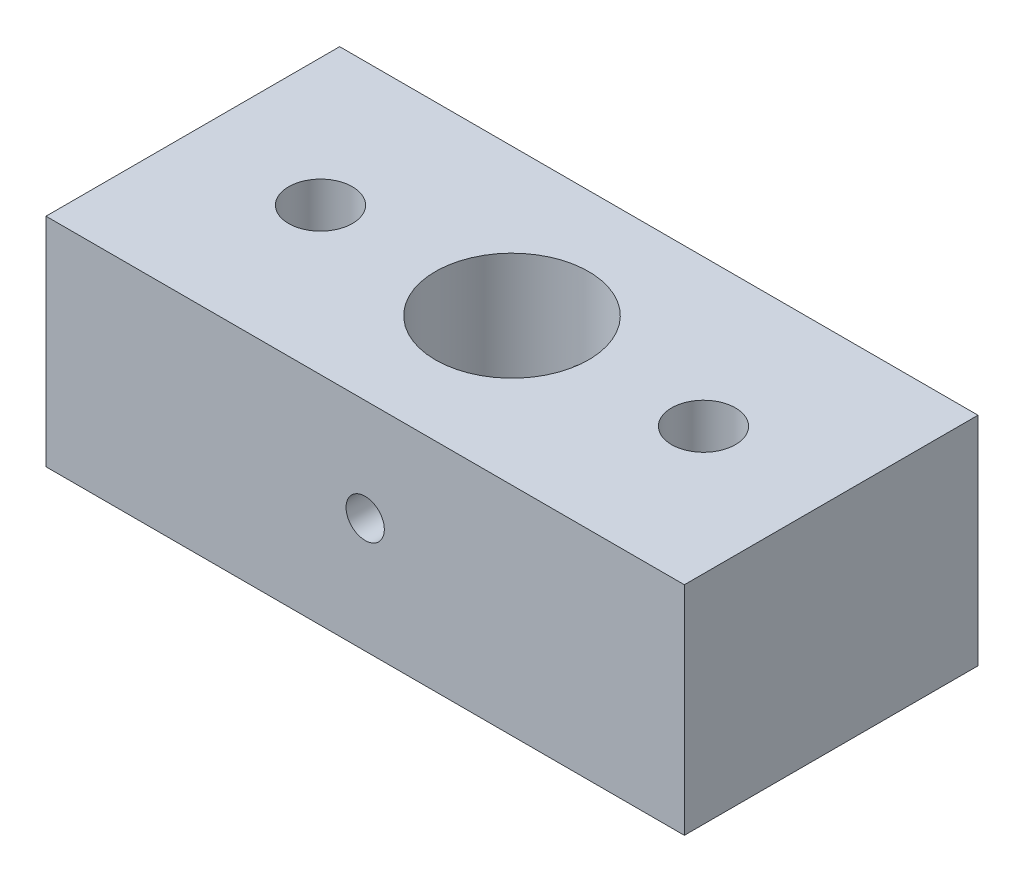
ISO-10303-21;
HEADER;
FILE_DESCRIPTION(('STEP AP214'),'2;1');
FILE_NAME('part.step','',(''),(''),'','','');
FILE_SCHEMA(('AUTOMOTIVE_DESIGN { 1 0 10303 214 1 1 1 1 }'));
ENDSEC;
DATA;
#1=APPLICATION_CONTEXT('core data for automotive mechanical design processes');
#2=APPLICATION_PROTOCOL_DEFINITION('international standard','automotive_design',2000,#1);
#3=PRODUCT_CONTEXT('',#1,'mechanical');
#4=PRODUCT('Part','Part','',(#3));
#5=PRODUCT_RELATED_PRODUCT_CATEGORY('part','',(#4));
#6=PRODUCT_DEFINITION_FORMATION('','',#4);
#7=PRODUCT_DEFINITION_CONTEXT('part definition',#1,'design');
#8=PRODUCT_DEFINITION('design','',#6,#7);
#9=PRODUCT_DEFINITION_SHAPE('','',#8);
#10=(LENGTH_UNIT() NAMED_UNIT(*) SI_UNIT(.MILLI.,.METRE.));
#11=(NAMED_UNIT(*) PLANE_ANGLE_UNIT() SI_UNIT($,.RADIAN.));
#12=(NAMED_UNIT(*) SI_UNIT($,.STERADIAN.) SOLID_ANGLE_UNIT());
#13=UNCERTAINTY_MEASURE_WITH_UNIT(LENGTH_MEASURE(1.E-05),#10,'distance_accuracy_value','');
#14=(GEOMETRIC_REPRESENTATION_CONTEXT(3) GLOBAL_UNCERTAINTY_ASSIGNED_CONTEXT((#13)) GLOBAL_UNIT_ASSIGNED_CONTEXT((#10,
#11,#12)) REPRESENTATION_CONTEXT('',''));
#15=CARTESIAN_POINT('',(0.,0.,0.));
#16=DIRECTION('',(0.,0.,1.));
#17=DIRECTION('',(1.,0.,0.));
#18=AXIS2_PLACEMENT_3D('',#15,#16,#17);
#19=CARTESIAN_POINT('',(7.41385041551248,-6.42728531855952,23.));
#20=DIRECTION('',(1.,0.,0.));
#21=DIRECTION('',(0.,1.,0.));
#22=AXIS2_PLACEMENT_3D('',#19,#20,#21);
#23=PLANE('',#22);
#24=DIRECTION('',(0.,-1.,0.));
#25=VECTOR('',#24,1.);
#26=CARTESIAN_POINT('',(7.41385041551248,-6.42728531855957,0.));
#27=LINE('',#26,#25);
#28=CARTESIAN_POINT('',(7.41385041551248,-6.42728531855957,0.));
#29=VERTEX_POINT('',#28);
#30=CARTESIAN_POINT('',(7.41385041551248,-23.4272853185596,0.));
#31=VERTEX_POINT('',#30);
#32=EDGE_CURVE('E80',#29,#31,#27,.T.);
#33=ORIENTED_EDGE('',*,*,#32,.T.);
#34=DIRECTION('',(0.,0.,-1.));
#35=VECTOR('',#34,1.);
#36=CARTESIAN_POINT('',(7.41385041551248,-23.4272853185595,23.));
#37=LINE('',#36,#35);
#38=CARTESIAN_POINT('',(7.41385041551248,-23.4272853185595,23.));
#39=VERTEX_POINT('',#38);
#40=EDGE_CURVE('E11',#39,#31,#37,.T.);
#41=ORIENTED_EDGE('',*,*,#40,.F.);
#42=DIRECTION('',(0.,-1.,0.));
#43=VECTOR('',#42,1.);
#44=CARTESIAN_POINT('',(7.41385041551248,-6.42728531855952,23.));
#45=LINE('',#44,#43);
#46=CARTESIAN_POINT('',(7.41385041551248,-6.42728531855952,23.));
#47=VERTEX_POINT('',#46);
#48=EDGE_CURVE('E103',#47,#39,#45,.T.);
#49=ORIENTED_EDGE('',*,*,#48,.F.);
#50=DIRECTION('',(0.,0.,-1.));
#51=VECTOR('',#50,1.);
#52=CARTESIAN_POINT('',(7.41385041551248,-6.42728531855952,23.));
#53=LINE('',#52,#51);
#54=EDGE_CURVE('E92',#47,#29,#53,.T.);
#55=ORIENTED_EDGE('',*,*,#54,.T.);
#56=EDGE_LOOP('',(#33,#41,#49,#55));
#57=FACE_BOUND('',#56,.T.);
#58=ADVANCED_FACE('F30',(#57),#23,.F.);
#59=CARTESIAN_POINT('',(7.41385041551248,-23.4272853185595,23.));
#60=DIRECTION('',(0.,1.,0.));
#61=DIRECTION('',(0.,0.,1.));
#62=AXIS2_PLACEMENT_3D('',#59,#60,#61);
#63=PLANE('',#62);
#64=CARTESIAN_POINT('',(47.4138504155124,-23.4272853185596,11.5));
#65=DIRECTION('',(0.,1.,0.));
#66=DIRECTION('',(0.,0.,1.));
#67=AXIS2_PLACEMENT_3D('',#64,#65,#66);
#68=CIRCLE('',#67,2.5);
#69=CARTESIAN_POINT('',(47.4138504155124,-23.4272853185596,14.));
#70=VERTEX_POINT('',#69);
#71=EDGE_CURVE('E173',#70,#70,#68,.T.);
#72=ORIENTED_EDGE('',*,*,#71,.T.);
#73=EDGE_LOOP('',(#72));
#74=FACE_BOUND('',#73,.T.);
#75=CARTESIAN_POINT('',(17.4138504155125,-23.4272853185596,11.5));
#76=DIRECTION('',(0.,1.,0.));
#77=DIRECTION('',(0.,0.,1.));
#78=AXIS2_PLACEMENT_3D('',#75,#76,#77);
#79=CIRCLE('',#78,2.5);
#80=CARTESIAN_POINT('',(17.4138504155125,-23.4272853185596,14.));
#81=VERTEX_POINT('',#80);
#82=EDGE_CURVE('E178',#81,#81,#79,.T.);
#83=ORIENTED_EDGE('',*,*,#82,.T.);
#84=EDGE_LOOP('',(#83));
#85=FACE_BOUND('',#84,.T.);
#86=CARTESIAN_POINT('',(32.4138504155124,-23.4272853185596,11.5));
#87=DIRECTION('',(0.,1.,0.));
#88=DIRECTION('',(0.,0.,1.));
#89=AXIS2_PLACEMENT_3D('',#86,#87,#88);
#90=CIRCLE('',#89,6.);
#91=CARTESIAN_POINT('',(32.4138504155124,-23.4272853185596,17.5));
#92=VERTEX_POINT('',#91);
#93=EDGE_CURVE('E93',#92,#92,#90,.T.);
#94=ORIENTED_EDGE('',*,*,#93,.T.);
#95=EDGE_LOOP('',(#94));
#96=FACE_BOUND('',#95,.T.);
#97=DIRECTION('',(1.,0.,0.));
#98=VECTOR('',#97,1.);
#99=CARTESIAN_POINT('',(7.41385041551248,-23.4272853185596,0.));
#100=LINE('',#99,#98);
#101=CARTESIAN_POINT('',(57.4138504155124,-23.4272853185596,0.));
#102=VERTEX_POINT('',#101);
#103=EDGE_CURVE('E76',#31,#102,#100,.T.);
#104=ORIENTED_EDGE('',*,*,#103,.T.);
#105=DIRECTION('',(0.,0.,-1.));
#106=VECTOR('',#105,1.);
#107=CARTESIAN_POINT('',(57.4138504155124,-23.4272853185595,23.));
#108=LINE('',#107,#106);
#109=CARTESIAN_POINT('',(57.4138504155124,-23.4272853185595,23.));
#110=VERTEX_POINT('',#109);
#111=EDGE_CURVE('E42',#110,#102,#108,.T.);
#112=ORIENTED_EDGE('',*,*,#111,.F.);
#113=DIRECTION('',(1.,0.,0.));
#114=VECTOR('',#113,1.);
#115=CARTESIAN_POINT('',(7.41385041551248,-23.4272853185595,23.));
#116=LINE('',#115,#114);
#117=EDGE_CURVE('E88',#39,#110,#116,.T.);
#118=ORIENTED_EDGE('',*,*,#117,.F.);
#119=ORIENTED_EDGE('',*,*,#40,.T.);
#120=EDGE_LOOP('',(#104,#112,#118,#119));
#121=FACE_BOUND('',#120,.T.);
#122=ADVANCED_FACE('F87',(#74,#85,#96,#121),#63,.F.);
#123=CARTESIAN_POINT('',(57.4138504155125,-6.42728531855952,23.));
#124=DIRECTION('',(-1.,0.,0.));
#125=DIRECTION('',(0.,-1.,0.));
#126=AXIS2_PLACEMENT_3D('',#123,#124,#125);
#127=PLANE('',#126);
#128=DIRECTION('',(0.,1.,0.));
#129=VECTOR('',#128,1.);
#130=CARTESIAN_POINT('',(57.4138504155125,-6.42728531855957,0.));
#131=LINE('',#130,#129);
#132=CARTESIAN_POINT('',(57.4138504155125,-6.42728531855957,0.));
#133=VERTEX_POINT('',#132);
#134=EDGE_CURVE('E81',#102,#133,#131,.T.);
#135=ORIENTED_EDGE('',*,*,#134,.T.);
#136=DIRECTION('',(0.,0.,-1.));
#137=VECTOR('',#136,1.);
#138=CARTESIAN_POINT('',(57.4138504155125,-6.42728531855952,23.));
#139=LINE('',#138,#137);
#140=CARTESIAN_POINT('',(57.4138504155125,-6.42728531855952,23.));
#141=VERTEX_POINT('',#140);
#142=EDGE_CURVE('E109',#141,#133,#139,.T.);
#143=ORIENTED_EDGE('',*,*,#142,.F.);
#144=DIRECTION('',(0.,1.,0.));
#145=VECTOR('',#144,1.);
#146=CARTESIAN_POINT('',(57.4138504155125,-6.42728531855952,23.));
#147=LINE('',#146,#145);
#148=EDGE_CURVE('E55',#110,#141,#147,.T.);
#149=ORIENTED_EDGE('',*,*,#148,.F.);
#150=ORIENTED_EDGE('',*,*,#111,.T.);
#151=EDGE_LOOP('',(#135,#143,#149,#150));
#152=FACE_BOUND('',#151,.T.);
#153=ADVANCED_FACE('F144',(#152),#127,.F.);
#154=CARTESIAN_POINT('',(7.41385041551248,-6.42728531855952,23.));
#155=DIRECTION('',(0.,-1.,0.));
#156=DIRECTION('',(0.,0.,-1.));
#157=AXIS2_PLACEMENT_3D('',#154,#155,#156);
#158=PLANE('',#157);
#159=CARTESIAN_POINT('',(47.4138504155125,-6.42728531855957,11.5));
#160=DIRECTION('',(0.,1.,0.));
#161=DIRECTION('',(0.,0.,1.));
#162=AXIS2_PLACEMENT_3D('',#159,#160,#161);
#163=CIRCLE('',#162,2.49999999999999);
#164=CARTESIAN_POINT('',(47.4138504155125,-6.42728531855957,14.));
#165=VERTEX_POINT('',#164);
#166=EDGE_CURVE('E175',#165,#165,#163,.T.);
#167=ORIENTED_EDGE('',*,*,#166,.F.);
#168=EDGE_LOOP('',(#167));
#169=FACE_BOUND('',#168,.T.);
#170=CARTESIAN_POINT('',(17.4138504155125,-6.42728531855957,11.5));
#171=DIRECTION('',(0.,1.,0.));
#172=DIRECTION('',(0.,0.,1.));
#173=AXIS2_PLACEMENT_3D('',#170,#171,#172);
#174=CIRCLE('',#173,2.49999999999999);
#175=CARTESIAN_POINT('',(17.4138504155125,-6.42728531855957,14.));
#176=VERTEX_POINT('',#175);
#177=EDGE_CURVE('E181',#176,#176,#174,.T.);
#178=ORIENTED_EDGE('',*,*,#177,.F.);
#179=EDGE_LOOP('',(#178));
#180=FACE_BOUND('',#179,.T.);
#181=CARTESIAN_POINT('',(32.4138504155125,-6.42728531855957,11.5));
#182=DIRECTION('',(0.,1.,0.));
#183=DIRECTION('',(0.,0.,1.));
#184=AXIS2_PLACEMENT_3D('',#181,#182,#183);
#185=CIRCLE('',#184,6.);
#186=CARTESIAN_POINT('',(32.4138504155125,-6.42728531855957,17.5));
#187=VERTEX_POINT('',#186);
#188=EDGE_CURVE('E96',#187,#187,#185,.T.);
#189=ORIENTED_EDGE('',*,*,#188,.F.);
#190=EDGE_LOOP('',(#189));
#191=FACE_BOUND('',#190,.T.);
#192=DIRECTION('',(-1.,0.,0.));
#193=VECTOR('',#192,1.);
#194=CARTESIAN_POINT('',(7.41385041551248,-6.42728531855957,0.));
#195=LINE('',#194,#193);
#196=EDGE_CURVE('E101',#133,#29,#195,.T.);
#197=ORIENTED_EDGE('',*,*,#196,.T.);
#198=ORIENTED_EDGE('',*,*,#54,.F.);
#199=DIRECTION('',(-1.,0.,0.));
#200=VECTOR('',#199,1.);
#201=CARTESIAN_POINT('',(7.41385041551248,-6.42728531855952,23.));
#202=LINE('',#201,#200);
#203=EDGE_CURVE('E50',#141,#47,#202,.T.);
#204=ORIENTED_EDGE('',*,*,#203,.F.);
#205=ORIENTED_EDGE('',*,*,#142,.T.);
#206=EDGE_LOOP('',(#197,#198,#204,#205));
#207=FACE_BOUND('',#206,.T.);
#208=ADVANCED_FACE('F149',(#169,#180,#191,#207),#158,.F.);
#209=CARTESIAN_POINT('',(7.41385041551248,-23.4272853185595,23.));
#210=DIRECTION('',(0.,0.,1.));
#211=DIRECTION('',(1.,0.,0.));
#212=AXIS2_PLACEMENT_3D('',#209,#210,#211);
#213=PLANE('',#212);
#214=CARTESIAN_POINT('',(32.4138504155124,-14.4272853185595,23.));
#215=DIRECTION('',(0.,0.,1.));
#216=DIRECTION('',(1.,0.,0.));
#217=AXIS2_PLACEMENT_3D('',#214,#215,#216);
#218=CIRCLE('',#217,1.5);
#219=CARTESIAN_POINT('',(33.9138504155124,-14.4272853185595,23.));
#220=VERTEX_POINT('',#219);
#221=EDGE_CURVE('E168',#220,#220,#218,.T.);
#222=ORIENTED_EDGE('',*,*,#221,.F.);
#223=EDGE_LOOP('',(#222));
#224=FACE_BOUND('',#223,.T.);
#225=ORIENTED_EDGE('',*,*,#48,.T.);
#226=ORIENTED_EDGE('',*,*,#117,.T.);
#227=ORIENTED_EDGE('',*,*,#148,.T.);
#228=ORIENTED_EDGE('',*,*,#203,.T.);
#229=EDGE_LOOP('',(#225,#226,#227,#228));
#230=FACE_BOUND('',#229,.T.);
#231=ADVANCED_FACE('F157',(#224,#230),#213,.T.);
#232=CARTESIAN_POINT('',(7.41385041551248,-23.4272853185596,0.));
#233=DIRECTION('',(0.,0.,1.));
#234=DIRECTION('',(1.,0.,0.));
#235=AXIS2_PLACEMENT_3D('',#232,#233,#234);
#236=PLANE('',#235);
#237=CARTESIAN_POINT('',(32.4138504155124,-14.4272853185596,0.));
#238=DIRECTION('',(0.,0.,1.));
#239=DIRECTION('',(1.,0.,0.));
#240=AXIS2_PLACEMENT_3D('',#237,#238,#239);
#241=CIRCLE('',#240,1.5);
#242=CARTESIAN_POINT('',(33.9138504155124,-14.4272853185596,0.));
#243=VERTEX_POINT('',#242);
#244=EDGE_CURVE('E116',#243,#243,#241,.T.);
#245=ORIENTED_EDGE('',*,*,#244,.T.);
#246=EDGE_LOOP('',(#245));
#247=FACE_BOUND('',#246,.T.);
#248=ORIENTED_EDGE('',*,*,#32,.F.);
#249=ORIENTED_EDGE('',*,*,#196,.F.);
#250=ORIENTED_EDGE('',*,*,#134,.F.);
#251=ORIENTED_EDGE('',*,*,#103,.F.);
#252=EDGE_LOOP('',(#248,#249,#250,#251));
#253=FACE_BOUND('',#252,.T.);
#254=ADVANCED_FACE('F77',(#247,#253),#236,.F.);
#255=CARTESIAN_POINT('',(32.4138504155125,-29.4272853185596,11.5));
#256=DIRECTION('',(0.,1.,0.));
#257=DIRECTION('',(0.,0.,1.));
#258=AXIS2_PLACEMENT_3D('',#255,#256,#257);
#259=CYLINDRICAL_SURFACE('',#258,6.);
#260=CARTESIAN_POINT('',(32.4138504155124,-15.9272853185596,17.5));
#261=CARTESIAN_POINT('',(32.4967265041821,-15.9272829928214,17.4999985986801));
#262=CARTESIAN_POINT('',(32.5796285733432,-15.9203937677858,17.4982657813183));
#263=CARTESIAN_POINT('',(32.7430567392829,-15.8930601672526,17.4915211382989));
#264=CARTESIAN_POINT('',(32.8235814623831,-15.8726081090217,17.4865074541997));
#265=CARTESIAN_POINT('',(32.979871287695,-15.8188460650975,17.4737562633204));
#266=CARTESIAN_POINT('',(33.0556419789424,-15.7855515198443,17.4660220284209));
#267=CARTESIAN_POINT('',(33.2005225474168,-15.7071039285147,17.4486534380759));
#268=CARTESIAN_POINT('',(33.2696321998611,-15.6619504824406,17.4390190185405));
#269=CARTESIAN_POINT('',(33.4006523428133,-15.5600845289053,17.418674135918));
#270=CARTESIAN_POINT('',(33.4624061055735,-15.5031737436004,17.4079470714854));
#271=CARTESIAN_POINT('',(33.5755993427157,-15.3798331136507,17.3867362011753));
#272=CARTESIAN_POINT('',(33.6270376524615,-15.3134021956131,17.3762524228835));
#273=CARTESIAN_POINT('',(33.7188769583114,-15.1716900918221,17.3565477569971));
#274=CARTESIAN_POINT('',(33.7591026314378,-15.0962920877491,17.3473479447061));
#275=CARTESIAN_POINT('',(33.8262473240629,-14.9395369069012,17.3314949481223));
#276=CARTESIAN_POINT('',(33.8531684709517,-14.8581806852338,17.3248413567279));
#277=CARTESIAN_POINT('',(33.8924052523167,-14.6935418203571,17.3150047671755));
#278=CARTESIAN_POINT('',(33.9050026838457,-14.6103304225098,17.3117549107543));
#279=CARTESIAN_POINT('',(33.9161121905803,-14.4429167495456,17.3088936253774));
#280=CARTESIAN_POINT('',(33.9146265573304,-14.358714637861,17.3092816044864));
#281=CARTESIAN_POINT('',(33.8978369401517,-14.1938695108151,17.3135920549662));
#282=CARTESIAN_POINT('',(33.8828687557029,-14.1131896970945,17.3174286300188));
#283=CARTESIAN_POINT('',(33.8400746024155,-13.9555242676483,17.3280670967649));
#284=CARTESIAN_POINT('',(33.8122477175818,-13.8785389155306,17.334869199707));
#285=CARTESIAN_POINT('',(33.7442398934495,-13.7295473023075,17.3507511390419));
#286=CARTESIAN_POINT('',(33.7039370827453,-13.65759914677,17.3598532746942));
#287=CARTESIAN_POINT('',(33.6122066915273,-13.5213666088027,17.3792971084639));
#288=CARTESIAN_POINT('',(33.5607771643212,-13.4570835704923,17.3896390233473));
#289=CARTESIAN_POINT('',(33.4465138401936,-13.3360817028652,17.4107588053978));
#290=CARTESIAN_POINT('',(33.3833966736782,-13.2796308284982,17.4215406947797));
#291=CARTESIAN_POINT('',(33.2484623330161,-13.1780640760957,17.4420596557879));
#292=CARTESIAN_POINT('',(33.1766448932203,-13.132948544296,17.4517966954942));
#293=CARTESIAN_POINT('',(33.0259663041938,-13.0552347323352,17.4691773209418));
#294=CARTESIAN_POINT('',(32.947081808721,-13.0226799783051,17.4768136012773));
#295=CARTESIAN_POINT('',(32.7847264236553,-12.97136801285,17.4890791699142));
#296=CARTESIAN_POINT('',(32.7012564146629,-12.9526081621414,17.4937090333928));
#297=CARTESIAN_POINT('',(32.5343903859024,-12.9298277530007,17.4993549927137));
#298=CARTESIAN_POINT('',(32.4510471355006,-12.9254422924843,17.5004605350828));
#299=CARTESIAN_POINT('',(32.2848175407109,-12.9305343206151,17.4991880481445));
#300=CARTESIAN_POINT('',(32.2019311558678,-12.9400105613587,17.4968103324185));
#301=CARTESIAN_POINT('',(32.0402361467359,-12.9722562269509,17.4888958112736));
#302=CARTESIAN_POINT('',(31.9613852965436,-12.9948265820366,17.4834063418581));
#303=CARTESIAN_POINT('',(31.8085931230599,-13.052392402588,17.4698870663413));
#304=CARTESIAN_POINT('',(31.7346522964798,-13.0873891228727,17.4618570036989));
#305=CARTESIAN_POINT('',(31.5923272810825,-13.1695214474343,17.4439330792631));
#306=CARTESIAN_POINT('',(31.5240649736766,-13.2168614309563,17.4340086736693));
#307=CARTESIAN_POINT('',(31.3963238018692,-13.3220752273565,17.4134450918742));
#308=CARTESIAN_POINT('',(31.3368464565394,-13.3799508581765,17.402805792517));
#309=CARTESIAN_POINT('',(31.2268598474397,-13.506287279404,17.3816895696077));
#310=CARTESIAN_POINT('',(31.1766065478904,-13.574973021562,17.3712230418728));
#311=CARTESIAN_POINT('',(31.0883396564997,-13.7200179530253,17.3519287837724));
#312=CARTESIAN_POINT('',(31.0503255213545,-13.7963768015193,17.3431009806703));
#313=CARTESIAN_POINT('',(30.9878989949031,-13.9541910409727,17.3281809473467));
#314=CARTESIAN_POINT('',(30.9634060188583,-14.0356129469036,17.322072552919));
#315=CARTESIAN_POINT('',(30.9285047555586,-14.2015949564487,17.3132674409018));
#316=CARTESIAN_POINT('',(30.9180933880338,-14.2861543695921,17.3105699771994));
#317=CARTESIAN_POINT('',(30.9118118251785,-14.4534063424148,17.3089490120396));
#318=CARTESIAN_POINT('',(30.9155325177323,-14.5360827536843,17.3099193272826));
#319=CARTESIAN_POINT('',(30.9364731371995,-14.6995892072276,17.3152790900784));
#320=CARTESIAN_POINT('',(30.9536927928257,-14.7804192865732,17.3196684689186));
#321=CARTESIAN_POINT('',(31.0009190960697,-14.937493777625,17.3313126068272));
#322=CARTESIAN_POINT('',(31.030849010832,-15.0137626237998,17.3385501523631));
#323=CARTESIAN_POINT('',(31.1025855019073,-15.1602507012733,17.3550775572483));
#324=CARTESIAN_POINT('',(31.1443937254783,-15.2304690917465,17.3643677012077));
#325=CARTESIAN_POINT('',(31.2399826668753,-15.3648399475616,17.3842563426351));
#326=CARTESIAN_POINT('',(31.2940472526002,-15.4287863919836,17.3948826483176));
#327=CARTESIAN_POINT('',(31.4120610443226,-15.546832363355,17.4160802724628));
#328=CARTESIAN_POINT('',(31.4760125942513,-15.6009295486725,17.4266515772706));
#329=CARTESIAN_POINT('',(31.6133828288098,-15.6986966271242,17.4467765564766));
#330=CARTESIAN_POINT('',(31.686951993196,-15.7421599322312,17.4563083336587));
#331=CARTESIAN_POINT('',(31.8405843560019,-15.8160327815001,17.4730492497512));
#332=CARTESIAN_POINT('',(31.9206428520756,-15.8464516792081,17.4802600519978));
#333=CARTESIAN_POINT('',(32.0694401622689,-15.8888571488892,17.4904805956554));
#334=CARTESIAN_POINT('',(32.1374702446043,-15.903236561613,17.4940258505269));
#335=CARTESIAN_POINT('',(32.2749443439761,-15.9224512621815,17.4987860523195));
#336=CARTESIAN_POINT('',(32.3443882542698,-15.9272872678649,17.5000011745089));
#337=CARTESIAN_POINT('',(32.4138504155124,-15.9272853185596,17.5));
#338=B_SPLINE_CURVE_WITH_KNOTS('',3,(#260,#261,#262,#263,#264,#265,#266,#267,#268,#269,#270,
#271,#272,#273,#274,#275,#276,#277,#278,#279,#280,#281,#282,#283,#284,#285,#286,#287,#288,#289,
#290,#291,#292,#293,#294,#295,#296,#297,#298,#299,#300,#301,#302,#303,#304,#305,#306,#307,#308,
#309,#310,#311,#312,#313,#314,#315,#316,#317,#318,#319,#320,#321,#322,#323,#324,#325,#326,#327,
#328,#329,#330,#331,#332,#333,#334,#335,#336,#337),.UNSPECIFIED.,.T.,.F.,(4,2,2,2,2,2,2,2,2,2,2,
2,2,2,2,2,2,2,2,2,2,2,2,2,2,2,2,2,2,2,2,2,2,2,2,2,2,2,4),(0.,0.248373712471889,
0.496888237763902,0.745104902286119,0.993329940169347,1.24614435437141,1.49898729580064,
1.75558647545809,2.01214461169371,2.26356295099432,2.51494038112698,2.76022497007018,
3.00552703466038,3.25330527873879,3.50112690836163,3.7560150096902,4.01091089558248,
4.26668229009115,4.52240473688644,4.77158308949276,5.02073901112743,5.26620274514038,
5.51169127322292,5.76153587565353,6.0114236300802,6.26744509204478,6.5234551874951,
6.77792254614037,7.03233423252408,7.27943780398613,7.52653640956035,7.7721640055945,
8.01782568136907,8.26989576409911,8.52202569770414,8.77872185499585,9.03523363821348,
9.24342242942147,9.45159556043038),.UNSPECIFIED.);
#339=CARTESIAN_POINT('',(32.4138504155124,-15.9272853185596,17.5));
#340=VERTEX_POINT('',#339);
#341=EDGE_CURVE('E33',#340,#340,#338,.T.);
#342=ORIENTED_EDGE('',*,*,#341,.T.);
#343=EDGE_LOOP('',(#342));
#344=FACE_BOUND('',#343,.T.);
#345=CARTESIAN_POINT('',(33.9138504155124,-14.4272853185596,5.69052498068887));
#346=CARTESIAN_POINT('',(33.9138480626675,-14.5101157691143,5.69052339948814));
#347=CARTESIAN_POINT('',(33.9069661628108,-14.5929722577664,5.68873416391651));
#348=CARTESIAN_POINT('',(33.8796642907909,-14.756305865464,5.68178882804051));
#349=CARTESIAN_POINT('',(33.8592364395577,-14.8367815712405,5.67663076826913));
#350=CARTESIAN_POINT('',(33.8055451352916,-14.9929674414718,5.66356765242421));
#351=CARTESIAN_POINT('',(33.7722982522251,-15.068683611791,5.65566614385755));
#352=CARTESIAN_POINT('',(33.6939631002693,-15.2134718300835,5.63801084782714));
#353=CARTESIAN_POINT('',(33.6488743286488,-15.2825435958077,5.62825698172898));
#354=CARTESIAN_POINT('',(33.5470754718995,-15.4136023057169,5.60775570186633));
#355=CARTESIAN_POINT('',(33.4901525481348,-15.4754214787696,5.59699241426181));
#356=CARTESIAN_POINT('',(33.3667596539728,-15.5887421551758,5.57582274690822));
#357=CARTESIAN_POINT('',(33.3002887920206,-15.6402426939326,5.56541640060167));
#358=CARTESIAN_POINT('',(33.1585375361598,-15.7321505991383,5.54595750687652));
#359=CARTESIAN_POINT('',(33.0831471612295,-15.7723931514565,5.53692587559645));
#360=CARTESIAN_POINT('',(32.9264083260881,-15.8395711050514,5.5214151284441));
#361=CARTESIAN_POINT('',(32.8450607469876,-15.8665084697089,5.51493563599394));
#362=CARTESIAN_POINT('',(32.6804656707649,-15.9057740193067,5.50537144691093));
#363=CARTESIAN_POINT('',(32.5972900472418,-15.9183871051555,5.50222063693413));
#364=CARTESIAN_POINT('',(32.4299477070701,-15.9295403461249,5.49943843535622));
#365=CARTESIAN_POINT('',(32.3457811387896,-15.9280825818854,5.49980652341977));
#366=CARTESIAN_POINT('',(32.1808220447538,-15.9113404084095,5.50397143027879));
#367=CARTESIAN_POINT('',(32.0999960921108,-15.8963635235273,5.50769198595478));
#368=CARTESIAN_POINT('',(31.9420430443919,-15.8535025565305,5.51805498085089));
#369=CARTESIAN_POINT('',(31.8649161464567,-15.8256177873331,5.52469757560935));
#370=CARTESIAN_POINT('',(31.7157403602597,-15.7574837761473,5.54027494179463));
#371=CARTESIAN_POINT('',(31.6437436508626,-15.7171250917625,5.54922988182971));
#372=CARTESIAN_POINT('',(31.5074369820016,-15.6252719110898,5.56846057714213));
#373=CARTESIAN_POINT('',(31.4431283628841,-15.5737754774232,5.57873656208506));
#374=CARTESIAN_POINT('',(31.322189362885,-15.4594600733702,5.59981771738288));
#375=CARTESIAN_POINT('',(31.2658138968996,-15.3963723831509,5.61062968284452));
#376=CARTESIAN_POINT('',(31.1643858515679,-15.2615253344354,5.63130973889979));
#377=CARTESIAN_POINT('',(31.1193338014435,-15.189765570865,5.64117778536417));
#378=CARTESIAN_POINT('',(31.0416682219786,-15.0391112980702,5.65887701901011));
#379=CARTESIAN_POINT('',(31.0091160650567,-14.9601838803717,5.66669809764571));
#380=CARTESIAN_POINT('',(30.9578219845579,-14.7977340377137,5.67928815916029));
#381=CARTESIAN_POINT('',(30.9390771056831,-14.7142126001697,5.68405779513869));
#382=CARTESIAN_POINT('',(30.9163526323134,-14.5473096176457,5.68986786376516));
#383=CARTESIAN_POINT('',(30.9119961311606,-14.4639826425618,5.69100346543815));
#384=CARTESIAN_POINT('',(30.917140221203,-14.2977921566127,5.6896759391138));
#385=CARTESIAN_POINT('',(30.9266395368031,-14.2149286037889,5.68721314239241));
#386=CARTESIAN_POINT('',(30.9588951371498,-14.0534167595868,5.67905750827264));
#387=CARTESIAN_POINT('',(30.9814319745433,-13.9747216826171,5.67341817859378));
#388=CARTESIAN_POINT('',(31.03887956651,-13.8222264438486,5.65959569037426));
#389=CARTESIAN_POINT('',(31.0737917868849,-13.7484268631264,5.65141223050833));
#390=CARTESIAN_POINT('',(31.1557880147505,-13.6062205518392,5.63322317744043));
#391=CARTESIAN_POINT('',(31.203097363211,-13.5379480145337,5.62318498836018));
#392=CARTESIAN_POINT('',(31.3082599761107,-13.4101723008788,5.60249750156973));
#393=CARTESIAN_POINT('',(31.3661149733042,-13.3506705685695,5.59184810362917));
#394=CARTESIAN_POINT('',(31.4924563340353,-13.240598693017,5.57081558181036));
#395=CARTESIAN_POINT('',(31.561172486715,-13.1902892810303,5.56044578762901));
#396=CARTESIAN_POINT('',(31.7062963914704,-13.1019237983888,5.54141670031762));
#397=CARTESIAN_POINT('',(31.782703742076,-13.0638670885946,5.53275731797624));
#398=CARTESIAN_POINT('',(31.9405131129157,-13.0014176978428,5.51817930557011));
#399=CARTESIAN_POINT('',(32.0218743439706,-12.9769267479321,5.51224101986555));
#400=CARTESIAN_POINT('',(32.1877257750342,-12.9420091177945,5.50368823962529));
#401=CARTESIAN_POINT('',(32.2722153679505,-12.9315797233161,5.50107310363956));
#402=CARTESIAN_POINT('',(32.4394757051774,-12.9252339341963,5.49948745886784));
#403=CARTESIAN_POINT('',(32.5222311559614,-12.9289327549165,5.50042031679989));
#404=CARTESIAN_POINT('',(32.6859016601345,-12.9498570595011,5.50561155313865));
#405=CARTESIAN_POINT('',(32.7668167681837,-12.9670821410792,5.50986983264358));
#406=CARTESIAN_POINT('',(32.9241069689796,-13.0143636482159,5.52121850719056));
#407=CARTESIAN_POINT('',(33.0005041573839,-13.0443504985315,5.52829353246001));
#408=CARTESIAN_POINT('',(33.1472259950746,-13.1162411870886,5.54453066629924));
#409=CARTESIAN_POINT('',(33.21754987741,-13.1581465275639,5.55369303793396));
#410=CARTESIAN_POINT('',(33.3519533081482,-13.2538581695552,5.57339125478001));
#411=CARTESIAN_POINT('',(33.4158428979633,-13.3079255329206,5.58395474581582));
#412=CARTESIAN_POINT('',(33.5337729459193,-13.4259195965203,5.60514026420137));
#413=CARTESIAN_POINT('',(33.5878109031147,-13.4898487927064,5.61576230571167));
#414=CARTESIAN_POINT('',(33.6854934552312,-13.6271874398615,5.63608786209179));
#415=CARTESIAN_POINT('',(33.7289253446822,-13.7007515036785,5.64577054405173));
#416=CARTESIAN_POINT('',(33.8027407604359,-13.8543685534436,5.66284066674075));
#417=CARTESIAN_POINT('',(33.833133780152,-13.9344167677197,5.67022977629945));
#418=CARTESIAN_POINT('',(33.8754842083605,-14.0831508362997,5.68072136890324));
#419=CARTESIAN_POINT('',(33.8898401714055,-14.1511250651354,5.68437005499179));
#420=CARTESIAN_POINT('',(33.9090238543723,-14.2884886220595,5.68927242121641));
#421=CARTESIAN_POINT('',(33.9138523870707,-14.3578778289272,5.69052630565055));
#422=CARTESIAN_POINT('',(33.9138504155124,-14.4272853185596,5.69052498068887));
#423=B_SPLINE_CURVE_WITH_KNOTS('',3,(#345,#346,#347,#348,#349,#350,#351,#352,#353,#354,#355,
#356,#357,#358,#359,#360,#361,#362,#363,#364,#365,#366,#367,#368,#369,#370,#371,#372,#373,#374,
#375,#376,#377,#378,#379,#380,#381,#382,#383,#384,#385,#386,#387,#388,#389,#390,#391,#392,#393,
#394,#395,#396,#397,#398,#399,#400,#401,#402,#403,#404,#405,#406,#407,#408,#409,#410,#411,#412,
#413,#414,#415,#416,#417,#418,#419,#420,#421,#422),.UNSPECIFIED.,.T.,.F.,(4,2,2,2,2,2,2,2,2,2,2,
2,2,2,2,2,2,2,2,2,2,2,2,2,2,2,2,2,2,2,2,2,2,2,2,2,2,2,4),(0.,0.248236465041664,
0.496617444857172,0.744678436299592,0.992749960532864,1.24574372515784,1.49876112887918,
1.7553089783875,2.01181895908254,2.26313250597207,2.51440889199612,2.76010957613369,
3.00582334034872,3.25375724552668,3.50173431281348,3.75642279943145,4.01112318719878,
4.26705859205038,4.52293920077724,4.77206144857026,5.02116076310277,5.26618443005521,
5.51123712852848,5.76109707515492,6.01099811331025,6.2671519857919,6.52329249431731,
6.77755243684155,7.03176329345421,7.27910067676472,7.52643070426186,7.77242925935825,
8.01845883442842,8.27038257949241,8.52237018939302,8.77905886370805,9.03556032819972,
9.24358696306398,9.45159585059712),.UNSPECIFIED.);
#424=CARTESIAN_POINT('',(33.9138504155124,-14.4272853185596,5.69052498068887));
#425=VERTEX_POINT('',#424);
#426=EDGE_CURVE('E112',#425,#425,#423,.T.);
#427=ORIENTED_EDGE('',*,*,#426,.T.);
#428=EDGE_LOOP('',(#427));
#429=FACE_BOUND('',#428,.T.);
#430=ORIENTED_EDGE('',*,*,#188,.T.);
#431=EDGE_LOOP('',(#430));
#432=FACE_BOUND('',#431,.T.);
#433=ORIENTED_EDGE('',*,*,#93,.F.);
#434=EDGE_LOOP('',(#433));
#435=FACE_BOUND('',#434,.T.);
#436=ADVANCED_FACE('F117',(#344,#429,#432,#435),#259,.F.);
#437=CARTESIAN_POINT('',(17.4138504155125,-6.42728531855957,11.5));
#438=DIRECTION('',(0.,1.,0.));
#439=DIRECTION('',(0.,0.,1.));
#440=AXIS2_PLACEMENT_3D('',#437,#438,#439);
#441=CYLINDRICAL_SURFACE('',#440,2.49999999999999);
#442=ORIENTED_EDGE('',*,*,#82,.F.);
#443=EDGE_LOOP('',(#442));
#444=FACE_BOUND('',#443,.T.);
#445=ORIENTED_EDGE('',*,*,#177,.T.);
#446=EDGE_LOOP('',(#445));
#447=FACE_BOUND('',#446,.T.);
#448=ADVANCED_FACE('F130',(#444,#447),#441,.F.);
#449=CARTESIAN_POINT('',(47.4138504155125,-6.42728531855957,11.5));
#450=DIRECTION('',(0.,1.,0.));
#451=DIRECTION('',(0.,0.,1.));
#452=AXIS2_PLACEMENT_3D('',#449,#450,#451);
#453=CYLINDRICAL_SURFACE('',#452,2.49999999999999);
#454=ORIENTED_EDGE('',*,*,#71,.F.);
#455=EDGE_LOOP('',(#454));
#456=FACE_BOUND('',#455,.T.);
#457=ORIENTED_EDGE('',*,*,#166,.T.);
#458=EDGE_LOOP('',(#457));
#459=FACE_BOUND('',#458,.T.);
#460=ADVANCED_FACE('F127',(#456,#459),#453,.F.);
#461=CARTESIAN_POINT('',(32.4138504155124,-14.4272853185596,0.));
#462=DIRECTION('',(0.,0.,1.));
#463=DIRECTION('',(1.,0.,0.));
#464=AXIS2_PLACEMENT_3D('',#461,#462,#463);
#465=CYLINDRICAL_SURFACE('',#464,1.5);
#466=ORIENTED_EDGE('',*,*,#244,.F.);
#467=EDGE_LOOP('',(#466));
#468=FACE_BOUND('',#467,.T.);
#469=ORIENTED_EDGE('',*,*,#426,.F.);
#470=EDGE_LOOP('',(#469));
#471=FACE_BOUND('',#470,.T.);
#472=ADVANCED_FACE('F125',(#468,#471),#465,.F.);
#473=ORIENTED_EDGE('',*,*,#221,.T.);
#474=EDGE_LOOP('',(#473));
#475=FACE_BOUND('',#474,.T.);
#476=ORIENTED_EDGE('',*,*,#341,.F.);
#477=EDGE_LOOP('',(#476));
#478=FACE_BOUND('',#477,.T.);
#479=ADVANCED_FACE('F121',(#475,#478),#465,.F.);
#480=CLOSED_SHELL('',(#58,#122,#153,#208,#231,#254,#436,#448,#460,#472,#479));
#481=MANIFOLD_SOLID_BREP('B2',#480);
#482=ADVANCED_BREP_SHAPE_REPRESENTATION('',(#18,#481),#14);
#483=SHAPE_DEFINITION_REPRESENTATION(#9,#482);
ENDSEC;
END-ISO-10303-21;
